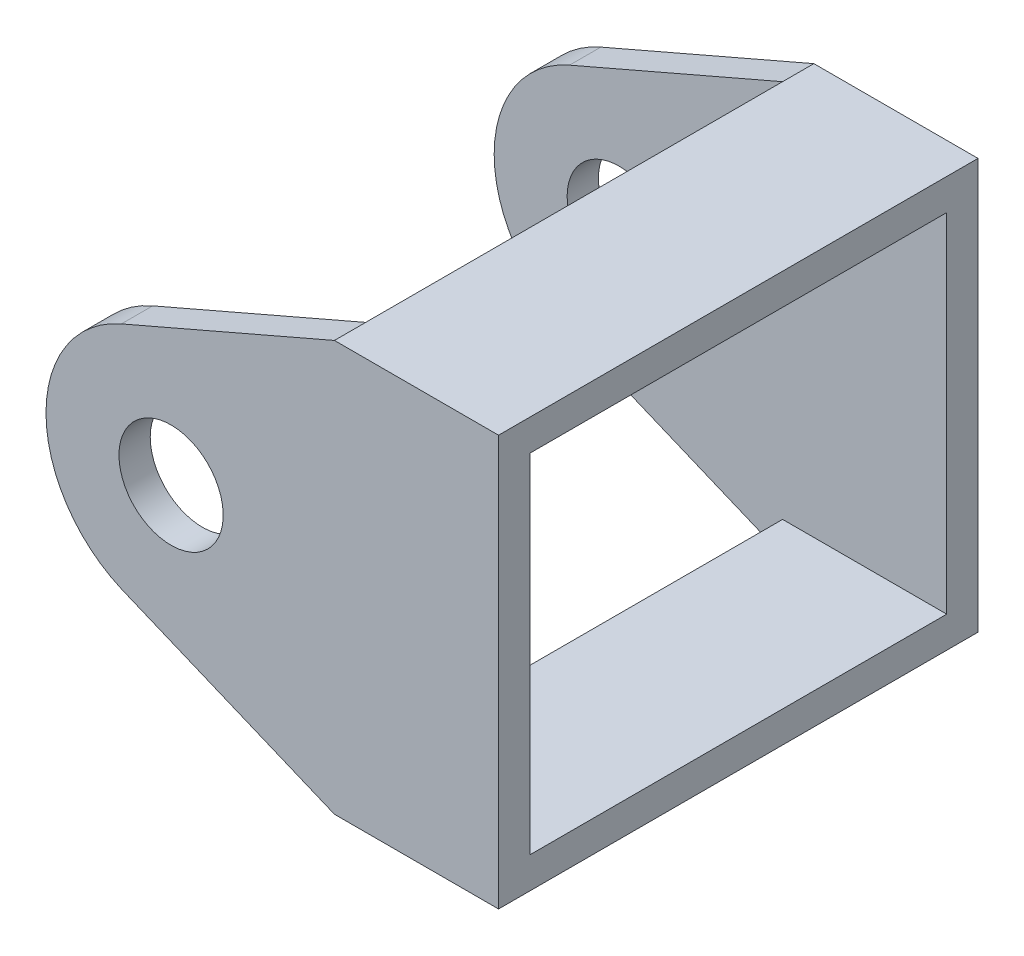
ISO-10303-21;
HEADER;
FILE_DESCRIPTION(('STEP AP214'),'2;1');
FILE_NAME('part.step','',(''),(''),'','','');
FILE_SCHEMA(('AUTOMOTIVE_DESIGN { 1 0 10303 214 1 1 1 1 }'));
ENDSEC;
DATA;
#1=APPLICATION_CONTEXT('core data for automotive mechanical design processes');
#2=APPLICATION_PROTOCOL_DEFINITION('international standard','automotive_design',2000,#1);
#3=PRODUCT_CONTEXT('',#1,'mechanical');
#4=PRODUCT('Part','Part','',(#3));
#5=PRODUCT_RELATED_PRODUCT_CATEGORY('part','',(#4));
#6=PRODUCT_DEFINITION_FORMATION('','',#4);
#7=PRODUCT_DEFINITION_CONTEXT('part definition',#1,'design');
#8=PRODUCT_DEFINITION('design','',#6,#7);
#9=PRODUCT_DEFINITION_SHAPE('','',#8);
#10=(LENGTH_UNIT() NAMED_UNIT(*) SI_UNIT(.MILLI.,.METRE.));
#11=(NAMED_UNIT(*) PLANE_ANGLE_UNIT() SI_UNIT($,.RADIAN.));
#12=(NAMED_UNIT(*) SI_UNIT($,.STERADIAN.) SOLID_ANGLE_UNIT());
#13=UNCERTAINTY_MEASURE_WITH_UNIT(LENGTH_MEASURE(1.E-05),#10,'distance_accuracy_value','');
#14=(GEOMETRIC_REPRESENTATION_CONTEXT(3) GLOBAL_UNCERTAINTY_ASSIGNED_CONTEXT((#13)) GLOBAL_UNIT_ASSIGNED_CONTEXT((#10,
#11,#12)) REPRESENTATION_CONTEXT('',''));
#15=CARTESIAN_POINT('',(0.,0.,0.));
#16=DIRECTION('',(0.,0.,1.));
#17=DIRECTION('',(1.,0.,0.));
#18=AXIS2_PLACEMENT_3D('',#15,#16,#17);
#19=CARTESIAN_POINT('',(-11.810708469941,-28.4050726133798,58.42));
#20=DIRECTION('',(0.383930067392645,0.923362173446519,0.));
#21=DIRECTION('',(-0.923362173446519,0.383930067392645,0.));
#22=AXIS2_PLACEMENT_3D('',#19,#20,#21);
#23=PLANE('',#22);
#24=DIRECTION('',(0.,0.,-1.));
#25=VECTOR('',#24,1.);
#26=CARTESIAN_POINT('',(-20.,-25.,58.42));
#27=LINE('',#26,#25);
#28=CARTESIAN_POINT('',(-20.,-25.,3.81));
#29=VERTEX_POINT('',#28);
#30=CARTESIAN_POINT('',(-20.,-25.,0.));
#31=VERTEX_POINT('',#30);
#32=EDGE_CURVE('E177',#29,#31,#27,.T.);
#33=ORIENTED_EDGE('',*,*,#32,.F.);
#34=DIRECTION('',(0.923362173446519,-0.383930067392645,0.));
#35=VECTOR('',#34,1.);
#36=CARTESIAN_POINT('',(-11.810708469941,-28.4050726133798,3.80999999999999));
#37=LINE('',#36,#35);
#38=CARTESIAN_POINT('',(-45.9577206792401,-14.2068900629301,3.80999999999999));
#39=VERTEX_POINT('',#38);
#40=EDGE_CURVE('E219',#39,#29,#37,.T.);
#41=ORIENTED_EDGE('',*,*,#40,.F.);
#42=DIRECTION('',(0.,0.,-1.));
#43=VECTOR('',#42,1.);
#44=CARTESIAN_POINT('',(-45.9577206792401,-14.2068900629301,58.42));
#45=LINE('',#44,#43);
#46=CARTESIAN_POINT('',(-45.9577206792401,-14.2068900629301,0.));
#47=VERTEX_POINT('',#46);
#48=EDGE_CURVE('E181',#39,#47,#45,.T.);
#49=ORIENTED_EDGE('',*,*,#48,.T.);
#50=DIRECTION('',(0.923362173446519,-0.383930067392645,0.));
#51=VECTOR('',#50,1.);
#52=CARTESIAN_POINT('',(-11.810708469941,-28.4050726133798,0.));
#53=LINE('',#52,#51);
#54=EDGE_CURVE('E257',#47,#31,#53,.T.);
#55=ORIENTED_EDGE('',*,*,#54,.T.);
#56=EDGE_LOOP('',(#33,#41,#49,#55));
#57=FACE_BOUND('',#56,.T.);
#58=ADVANCED_FACE('F34',(#57),#23,.F.);
#59=DIRECTION('',(-0.923362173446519,0.383930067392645,0.));
#60=VECTOR('',#59,1.);
#61=CARTESIAN_POINT('',(-11.810708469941,-28.4050726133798,54.61));
#62=LINE('',#61,#60);
#63=CARTESIAN_POINT('',(-20.,-25.,54.61));
#64=VERTEX_POINT('',#63);
#65=CARTESIAN_POINT('',(-45.9577206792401,-14.2068900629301,54.61));
#66=VERTEX_POINT('',#65);
#67=EDGE_CURVE('E226',#64,#66,#62,.T.);
#68=ORIENTED_EDGE('',*,*,#67,.F.);
#69=CARTESIAN_POINT('',(-20.,-25.,58.42));
#70=VERTEX_POINT('',#69);
#71=EDGE_CURVE('E178',#70,#64,#27,.T.);
#72=ORIENTED_EDGE('',*,*,#71,.F.);
#73=DIRECTION('',(0.923362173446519,-0.383930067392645,0.));
#74=VECTOR('',#73,1.);
#75=CARTESIAN_POINT('',(-11.810708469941,-28.4050726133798,58.42));
#76=LINE('',#75,#74);
#77=CARTESIAN_POINT('',(-45.9577206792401,-14.2068900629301,58.42));
#78=VERTEX_POINT('',#77);
#79=EDGE_CURVE('E240',#78,#70,#76,.T.);
#80=ORIENTED_EDGE('',*,*,#79,.F.);
#81=EDGE_CURVE('E182',#78,#66,#45,.T.);
#82=ORIENTED_EDGE('',*,*,#81,.T.);
#83=EDGE_LOOP('',(#68,#72,#80,#82));
#84=FACE_BOUND('',#83,.T.);
#85=ADVANCED_FACE('F300',(#84),#23,.F.);
#86=CARTESIAN_POINT('',(-12.2680259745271,28.3463263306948,58.42));
#87=DIRECTION('',(-0.397188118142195,0.917737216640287,0.));
#88=DIRECTION('',(-0.917737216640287,-0.397188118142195,0.));
#89=AXIS2_PLACEMENT_3D('',#86,#87,#88);
#90=PLANE('',#89);
#91=DIRECTION('',(0.917737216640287,0.397188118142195,0.));
#92=VECTOR('',#91,1.);
#93=CARTESIAN_POINT('',(-12.2680259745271,28.3463263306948,3.81));
#94=LINE('',#93,#92);
#95=CARTESIAN_POINT('',(-45.9577206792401,13.7657403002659,3.81));
#96=VERTEX_POINT('',#95);
#97=CARTESIAN_POINT('',(-20.,25.,3.81));
#98=VERTEX_POINT('',#97);
#99=EDGE_CURVE('E147',#96,#98,#94,.T.);
#100=ORIENTED_EDGE('',*,*,#99,.T.);
#101=DIRECTION('',(0.,0.,-1.));
#102=VECTOR('',#101,1.);
#103=CARTESIAN_POINT('',(-20.,25.,58.42));
#104=LINE('',#103,#102);
#105=CARTESIAN_POINT('',(-20.,25.,0.));
#106=VERTEX_POINT('',#105);
#107=EDGE_CURVE('E162',#98,#106,#104,.T.);
#108=ORIENTED_EDGE('',*,*,#107,.T.);
#109=DIRECTION('',(0.917737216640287,0.397188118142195,0.));
#110=VECTOR('',#109,1.);
#111=CARTESIAN_POINT('',(-12.2680259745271,28.3463263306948,0.));
#112=LINE('',#111,#110);
#113=CARTESIAN_POINT('',(-45.9577206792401,13.7657403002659,0.));
#114=VERTEX_POINT('',#113);
#115=EDGE_CURVE('E237',#114,#106,#112,.T.);
#116=ORIENTED_EDGE('',*,*,#115,.F.);
#117=DIRECTION('',(0.,0.,-1.));
#118=VECTOR('',#117,1.);
#119=CARTESIAN_POINT('',(-45.9577206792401,13.7657403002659,58.42));
#120=LINE('',#119,#118);
#121=EDGE_CURVE('E251',#96,#114,#120,.T.);
#122=ORIENTED_EDGE('',*,*,#121,.F.);
#123=EDGE_LOOP('',(#100,#108,#116,#122));
#124=FACE_BOUND('',#123,.T.);
#125=ADVANCED_FACE('F277',(#124),#90,.T.);
#126=CARTESIAN_POINT('',(-20.,25.,58.42));
#127=VERTEX_POINT('',#126);
#128=CARTESIAN_POINT('',(-20.,25.,54.61));
#129=VERTEX_POINT('',#128);
#130=EDGE_CURVE('E160',#127,#129,#104,.T.);
#131=ORIENTED_EDGE('',*,*,#130,.T.);
#132=DIRECTION('',(-0.917737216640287,-0.397188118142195,0.));
#133=VECTOR('',#132,1.);
#134=CARTESIAN_POINT('',(-12.2680259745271,28.3463263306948,54.61));
#135=LINE('',#134,#133);
#136=CARTESIAN_POINT('',(-45.9577206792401,13.7657403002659,54.61));
#137=VERTEX_POINT('',#136);
#138=EDGE_CURVE('E136',#129,#137,#135,.T.);
#139=ORIENTED_EDGE('',*,*,#138,.T.);
#140=CARTESIAN_POINT('',(-45.9577206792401,13.7657403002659,58.42));
#141=VERTEX_POINT('',#140);
#142=EDGE_CURVE('E172',#141,#137,#120,.T.);
#143=ORIENTED_EDGE('',*,*,#142,.F.);
#144=DIRECTION('',(0.917737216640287,0.397188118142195,0.));
#145=VECTOR('',#144,1.);
#146=CARTESIAN_POINT('',(-12.2680259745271,28.3463263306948,58.42));
#147=LINE('',#146,#145);
#148=EDGE_CURVE('E167',#141,#127,#147,.T.);
#149=ORIENTED_EDGE('',*,*,#148,.T.);
#150=EDGE_LOOP('',(#131,#139,#143,#149));
#151=FACE_BOUND('',#150,.T.);
#152=ADVANCED_FACE('F165',(#151),#90,.T.);
#153=CARTESIAN_POINT('',(20.,-21.19,54.61));
#154=DIRECTION('',(0.,1.,0.));
#155=DIRECTION('',(0.,0.,1.));
#156=AXIS2_PLACEMENT_3D('',#153,#154,#155);
#157=PLANE('',#156);
#158=DIRECTION('',(-1.,0.,0.));
#159=VECTOR('',#158,1.);
#160=CARTESIAN_POINT('',(20.,-21.19,3.80999999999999));
#161=LINE('',#160,#159);
#162=CARTESIAN_POINT('',(0.,-21.19,3.80999999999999));
#163=VERTEX_POINT('',#162);
#164=CARTESIAN_POINT('',(-20.,-21.19,3.81));
#165=VERTEX_POINT('',#164);
#166=EDGE_CURVE('E199',#163,#165,#161,.T.);
#167=ORIENTED_EDGE('',*,*,#166,.T.);
#168=DIRECTION('',(0.,0.,1.));
#169=VECTOR('',#168,1.);
#170=CARTESIAN_POINT('',(-20.,-21.19,54.61));
#171=LINE('',#170,#169);
#172=CARTESIAN_POINT('',(-20.,-21.19,54.61));
#173=VERTEX_POINT('',#172);
#174=EDGE_CURVE('E152',#165,#173,#171,.T.);
#175=ORIENTED_EDGE('',*,*,#174,.T.);
#176=DIRECTION('',(-1.,0.,0.));
#177=VECTOR('',#176,1.);
#178=CARTESIAN_POINT('',(20.,-21.19,54.61));
#179=LINE('',#178,#177);
#180=CARTESIAN_POINT('',(0.,-21.19,54.61));
#181=VERTEX_POINT('',#180);
#182=EDGE_CURVE('E201',#181,#173,#179,.T.);
#183=ORIENTED_EDGE('',*,*,#182,.F.);
#184=DIRECTION('',(0.,0.,1.));
#185=VECTOR('',#184,1.);
#186=CARTESIAN_POINT('',(0.,-21.19,58.42));
#187=LINE('',#186,#185);
#188=EDGE_CURVE('E42',#163,#181,#187,.T.);
#189=ORIENTED_EDGE('',*,*,#188,.F.);
#190=EDGE_LOOP('',(#167,#175,#183,#189));
#191=FACE_BOUND('',#190,.T.);
#192=ADVANCED_FACE('F198',(#191),#157,.T.);
#193=CARTESIAN_POINT('',(20.,21.19,54.61));
#194=DIRECTION('',(0.,-1.,0.));
#195=DIRECTION('',(0.,0.,-1.));
#196=AXIS2_PLACEMENT_3D('',#193,#194,#195);
#197=PLANE('',#196);
#198=DIRECTION('',(-1.,0.,0.));
#199=VECTOR('',#198,1.);
#200=CARTESIAN_POINT('',(20.,21.19,54.61));
#201=LINE('',#200,#199);
#202=CARTESIAN_POINT('',(0.,21.19,54.61));
#203=VERTEX_POINT('',#202);
#204=CARTESIAN_POINT('',(-20.,21.19,54.61));
#205=VERTEX_POINT('',#204);
#206=EDGE_CURVE('E212',#203,#205,#201,.T.);
#207=ORIENTED_EDGE('',*,*,#206,.T.);
#208=DIRECTION('',(0.,0.,-1.));
#209=VECTOR('',#208,1.);
#210=CARTESIAN_POINT('',(-20.,21.19,54.61));
#211=LINE('',#210,#209);
#212=CARTESIAN_POINT('',(-20.,21.19,3.81));
#213=VERTEX_POINT('',#212);
#214=EDGE_CURVE('E11',#205,#213,#211,.T.);
#215=ORIENTED_EDGE('',*,*,#214,.T.);
#216=DIRECTION('',(-1.,0.,0.));
#217=VECTOR('',#216,1.);
#218=CARTESIAN_POINT('',(20.,21.19,3.81));
#219=LINE('',#218,#217);
#220=CARTESIAN_POINT('',(0.,21.19,3.81));
#221=VERTEX_POINT('',#220);
#222=EDGE_CURVE('E208',#221,#213,#219,.T.);
#223=ORIENTED_EDGE('',*,*,#222,.F.);
#224=DIRECTION('',(0.,0.,-1.));
#225=VECTOR('',#224,1.);
#226=CARTESIAN_POINT('',(0.,21.19,58.42));
#227=LINE('',#226,#225);
#228=EDGE_CURVE('E210',#203,#221,#227,.T.);
#229=ORIENTED_EDGE('',*,*,#228,.F.);
#230=EDGE_LOOP('',(#207,#215,#223,#229));
#231=FACE_BOUND('',#230,.T.);
#232=ADVANCED_FACE('F306',(#231),#197,.T.);
#233=CARTESIAN_POINT('',(-39.9045737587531,-0.220574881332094,58.42));
#234=DIRECTION('',(0.,0.,-1.));
#235=DIRECTION('',(-1.,0.,0.));
#236=AXIS2_PLACEMENT_3D('',#233,#234,#235);
#237=CYLINDRICAL_SURFACE('',#236,15.24);
#238=ORIENTED_EDGE('',*,*,#142,.T.);
#239=CARTESIAN_POINT('',(-39.9045737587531,-0.220574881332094,54.61));
#240=DIRECTION('',(0.,0.,-1.));
#241=DIRECTION('',(-1.,0.,0.));
#242=AXIS2_PLACEMENT_3D('',#239,#240,#241);
#243=CIRCLE('',#242,15.24);
#244=EDGE_CURVE('E143',#66,#137,#243,.T.);
#245=ORIENTED_EDGE('',*,*,#244,.F.);
#246=ORIENTED_EDGE('',*,*,#81,.F.);
#247=CARTESIAN_POINT('',(-39.9045737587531,-0.220574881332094,58.42));
#248=DIRECTION('',(0.,0.,1.));
#249=DIRECTION('',(1.,0.,0.));
#250=AXIS2_PLACEMENT_3D('',#247,#248,#249);
#251=CIRCLE('',#250,15.24);
#252=EDGE_CURVE('E236',#141,#78,#251,.T.);
#253=ORIENTED_EDGE('',*,*,#252,.F.);
#254=EDGE_LOOP('',(#238,#245,#246,#253));
#255=FACE_BOUND('',#254,.T.);
#256=ADVANCED_FACE('F294',(#255),#237,.T.);
#257=CARTESIAN_POINT('',(-39.9045737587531,-0.220574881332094,3.80999999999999));
#258=DIRECTION('',(0.,0.,1.));
#259=DIRECTION('',(0.,-1.,0.));
#260=AXIS2_PLACEMENT_3D('',#257,#258,#259);
#261=CIRCLE('',#260,15.24);
#262=EDGE_CURVE('E217',#96,#39,#261,.T.);
#263=ORIENTED_EDGE('',*,*,#262,.F.);
#264=ORIENTED_EDGE('',*,*,#121,.T.);
#265=CARTESIAN_POINT('',(-39.9045737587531,-0.220574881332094,0.));
#266=DIRECTION('',(0.,0.,1.));
#267=DIRECTION('',(1.,0.,0.));
#268=AXIS2_PLACEMENT_3D('',#265,#266,#267);
#269=CIRCLE('',#268,15.24);
#270=EDGE_CURVE('E254',#114,#47,#269,.T.);
#271=ORIENTED_EDGE('',*,*,#270,.T.);
#272=ORIENTED_EDGE('',*,*,#48,.F.);
#273=EDGE_LOOP('',(#263,#264,#271,#272));
#274=FACE_BOUND('',#273,.T.);
#275=ADVANCED_FACE('F291',(#274),#237,.T.);
#276=CARTESIAN_POINT('',(0.,0.,58.42));
#277=DIRECTION('',(1.,0.,0.));
#278=DIRECTION('',(0.,0.,-1.));
#279=AXIS2_PLACEMENT_3D('',#276,#277,#278);
#280=PLANE('',#279);
#281=DIRECTION('',(0.,-1.,0.));
#282=VECTOR('',#281,1.);
#283=CARTESIAN_POINT('',(0.,0.,0.));
#284=LINE('',#283,#282);
#285=CARTESIAN_POINT('',(0.,25.,0.));
#286=VERTEX_POINT('',#285);
#287=CARTESIAN_POINT('',(0.,-25.,0.));
#288=VERTEX_POINT('',#287);
#289=EDGE_CURVE('E263',#286,#288,#284,.T.);
#290=ORIENTED_EDGE('',*,*,#289,.F.);
#291=DIRECTION('',(0.,0.,-1.));
#292=VECTOR('',#291,1.);
#293=CARTESIAN_POINT('',(0.,25.,58.42));
#294=LINE('',#293,#292);
#295=CARTESIAN_POINT('',(0.,25.,58.42));
#296=VERTEX_POINT('',#295);
#297=EDGE_CURVE('E168',#296,#286,#294,.T.);
#298=ORIENTED_EDGE('',*,*,#297,.F.);
#299=DIRECTION('',(0.,-1.,0.));
#300=VECTOR('',#299,1.);
#301=CARTESIAN_POINT('',(0.,0.,58.42));
#302=LINE('',#301,#300);
#303=CARTESIAN_POINT('',(0.,-25.,58.42));
#304=VERTEX_POINT('',#303);
#305=EDGE_CURVE('E245',#296,#304,#302,.T.);
#306=ORIENTED_EDGE('',*,*,#305,.T.);
#307=DIRECTION('',(0.,0.,-1.));
#308=VECTOR('',#307,1.);
#309=CARTESIAN_POINT('',(0.,-25.,58.42));
#310=LINE('',#309,#308);
#311=EDGE_CURVE('E170',#304,#288,#310,.T.);
#312=ORIENTED_EDGE('',*,*,#311,.T.);
#313=EDGE_LOOP('',(#290,#298,#306,#312));
#314=FACE_BOUND('',#313,.T.);
#315=ORIENTED_EDGE('',*,*,#188,.T.);
#316=DIRECTION('',(0.,1.,0.));
#317=VECTOR('',#316,1.);
#318=CARTESIAN_POINT('',(0.,0.,54.61));
#319=LINE('',#318,#317);
#320=EDGE_CURVE('E191',#181,#203,#319,.T.);
#321=ORIENTED_EDGE('',*,*,#320,.T.);
#322=ORIENTED_EDGE('',*,*,#228,.T.);
#323=DIRECTION('',(0.,-1.,0.));
#324=VECTOR('',#323,1.);
#325=CARTESIAN_POINT('',(0.,0.,3.81));
#326=LINE('',#325,#324);
#327=EDGE_CURVE('E193',#221,#163,#326,.T.);
#328=ORIENTED_EDGE('',*,*,#327,.T.);
#329=EDGE_LOOP('',(#315,#321,#322,#328));
#330=FACE_BOUND('',#329,.T.);
#331=ADVANCED_FACE('F189',(#314,#330),#280,.T.);
#332=CARTESIAN_POINT('',(-39.9045737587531,-0.220574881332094,58.42));
#333=DIRECTION('',(0.,0.,-1.));
#334=DIRECTION('',(-1.,0.,0.));
#335=AXIS2_PLACEMENT_3D('',#332,#333,#334);
#336=CYLINDRICAL_SURFACE('',#335,6.35);
#337=CARTESIAN_POINT('',(-39.9045737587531,-0.220574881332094,58.42));
#338=DIRECTION('',(0.,0.,1.));
#339=DIRECTION('',(1.,0.,0.));
#340=AXIS2_PLACEMENT_3D('',#337,#338,#339);
#341=CIRCLE('',#340,6.35);
#342=CARTESIAN_POINT('',(-46.2545737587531,-0.220574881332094,58.42));
#343=VERTEX_POINT('',#342);
#344=EDGE_CURVE('E233',#343,#343,#341,.T.);
#345=CARTESIAN_POINT('',(-39.9045737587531,-0.220574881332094,54.61));
#346=DIRECTION('',(0.,0.,-1.));
#347=DIRECTION('',(-1.,0.,0.));
#348=AXIS2_PLACEMENT_3D('',#345,#346,#347);
#349=CIRCLE('',#348,6.35);
#350=CARTESIAN_POINT('',(-46.2545737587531,-0.220574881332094,54.61));
#351=VERTEX_POINT('',#350);
#352=EDGE_CURVE('E228',#351,#351,#349,.T.);
#353=CARTESIAN_POINT('',(-46.2545737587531,-0.220574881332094,58.42));
#354=CARTESIAN_POINT('',(-46.2545737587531,-0.220574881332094,58.3803125));
#355=CARTESIAN_POINT('',(-46.2545737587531,-0.220574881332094,58.340625));
#356=CARTESIAN_POINT('',(-46.2545737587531,-0.220574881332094,58.26125));
#357=CARTESIAN_POINT('',(-46.2545737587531,-0.220574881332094,58.2215625));
#358=CARTESIAN_POINT('',(-46.2545737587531,-0.220574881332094,58.1421875));
#359=CARTESIAN_POINT('',(-46.2545737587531,-0.220574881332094,58.1025));
#360=CARTESIAN_POINT('',(-46.2545737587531,-0.220574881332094,58.023125));
#361=CARTESIAN_POINT('',(-46.2545737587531,-0.220574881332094,57.9834375));
#362=CARTESIAN_POINT('',(-46.2545737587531,-0.220574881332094,57.9040625));
#363=CARTESIAN_POINT('',(-46.2545737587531,-0.220574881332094,57.864375));
#364=CARTESIAN_POINT('',(-46.2545737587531,-0.220574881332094,57.785));
#365=CARTESIAN_POINT('',(-46.2545737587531,-0.220574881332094,57.7453125));
#366=CARTESIAN_POINT('',(-46.2545737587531,-0.220574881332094,57.6659375));
#367=CARTESIAN_POINT('',(-46.2545737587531,-0.220574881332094,57.62625));
#368=CARTESIAN_POINT('',(-46.2545737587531,-0.220574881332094,57.546875));
#369=CARTESIAN_POINT('',(-46.2545737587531,-0.220574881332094,57.5071875));
#370=CARTESIAN_POINT('',(-46.2545737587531,-0.220574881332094,57.4278125));
#371=CARTESIAN_POINT('',(-46.2545737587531,-0.220574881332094,57.388125));
#372=CARTESIAN_POINT('',(-46.2545737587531,-0.220574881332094,57.30875));
#373=CARTESIAN_POINT('',(-46.2545737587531,-0.220574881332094,57.2690625));
#374=CARTESIAN_POINT('',(-46.2545737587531,-0.220574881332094,57.1896875));
#375=CARTESIAN_POINT('',(-46.2545737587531,-0.220574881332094,57.15));
#376=CARTESIAN_POINT('',(-46.2545737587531,-0.220574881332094,57.070625));
#377=CARTESIAN_POINT('',(-46.2545737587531,-0.220574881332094,57.0309375));
#378=CARTESIAN_POINT('',(-46.2545737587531,-0.220574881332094,56.9515625));
#379=CARTESIAN_POINT('',(-46.2545737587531,-0.220574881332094,56.911875));
#380=CARTESIAN_POINT('',(-46.2545737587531,-0.220574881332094,56.8325));
#381=CARTESIAN_POINT('',(-46.2545737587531,-0.220574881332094,56.7928125));
#382=CARTESIAN_POINT('',(-46.2545737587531,-0.220574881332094,56.7134375));
#383=CARTESIAN_POINT('',(-46.2545737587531,-0.220574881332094,56.67375));
#384=CARTESIAN_POINT('',(-46.2545737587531,-0.220574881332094,56.594375));
#385=CARTESIAN_POINT('',(-46.2545737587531,-0.220574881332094,56.5546875));
#386=CARTESIAN_POINT('',(-46.2545737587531,-0.220574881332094,56.4753125));
#387=CARTESIAN_POINT('',(-46.2545737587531,-0.220574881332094,56.435625));
#388=CARTESIAN_POINT('',(-46.2545737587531,-0.220574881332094,56.35625));
#389=CARTESIAN_POINT('',(-46.2545737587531,-0.220574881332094,56.3165625));
#390=CARTESIAN_POINT('',(-46.2545737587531,-0.220574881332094,56.2371875));
#391=CARTESIAN_POINT('',(-46.2545737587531,-0.220574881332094,56.1975));
#392=CARTESIAN_POINT('',(-46.2545737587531,-0.220574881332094,56.118125));
#393=CARTESIAN_POINT('',(-46.2545737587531,-0.220574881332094,56.0784375));
#394=CARTESIAN_POINT('',(-46.2545737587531,-0.220574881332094,55.9990625));
#395=CARTESIAN_POINT('',(-46.2545737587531,-0.220574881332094,55.959375));
#396=CARTESIAN_POINT('',(-46.2545737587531,-0.220574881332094,55.88));
#397=CARTESIAN_POINT('',(-46.2545737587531,-0.220574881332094,55.8403125));
#398=CARTESIAN_POINT('',(-46.2545737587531,-0.220574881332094,55.7609375));
#399=CARTESIAN_POINT('',(-46.2545737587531,-0.220574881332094,55.72125));
#400=CARTESIAN_POINT('',(-46.2545737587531,-0.220574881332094,55.641875));
#401=CARTESIAN_POINT('',(-46.2545737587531,-0.220574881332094,55.6021875));
#402=CARTESIAN_POINT('',(-46.2545737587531,-0.220574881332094,55.5228125));
#403=CARTESIAN_POINT('',(-46.2545737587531,-0.220574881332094,55.483125));
#404=CARTESIAN_POINT('',(-46.2545737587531,-0.220574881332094,55.40375));
#405=CARTESIAN_POINT('',(-46.2545737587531,-0.220574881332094,55.3640625));
#406=CARTESIAN_POINT('',(-46.2545737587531,-0.220574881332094,55.2846875));
#407=CARTESIAN_POINT('',(-46.2545737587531,-0.220574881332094,55.245));
#408=CARTESIAN_POINT('',(-46.2545737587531,-0.220574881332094,55.165625));
#409=CARTESIAN_POINT('',(-46.2545737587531,-0.220574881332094,55.1259375));
#410=CARTESIAN_POINT('',(-46.2545737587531,-0.220574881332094,55.0465625));
#411=CARTESIAN_POINT('',(-46.2545737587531,-0.220574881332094,55.006875));
#412=CARTESIAN_POINT('',(-46.2545737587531,-0.220574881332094,54.9275));
#413=CARTESIAN_POINT('',(-46.2545737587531,-0.220574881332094,54.8878125));
#414=CARTESIAN_POINT('',(-46.2545737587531,-0.220574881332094,54.8084375));
#415=CARTESIAN_POINT('',(-46.2545737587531,-0.220574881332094,54.76875));
#416=CARTESIAN_POINT('',(-46.2545737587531,-0.220574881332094,54.689375));
#417=CARTESIAN_POINT('',(-46.2545737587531,-0.220574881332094,54.6496875));
#418=CARTESIAN_POINT('',(-46.2545737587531,-0.220574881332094,54.61));
#419=B_SPLINE_CURVE_WITH_KNOTS('',3,(#353,#354,#355,#356,#357,#358,#359,#360,#361,#362,#363,
#364,#365,#366,#367,#368,#369,#370,#371,#372,#373,#374,#375,#376,#377,#378,#379,#380,#381,#382,
#383,#384,#385,#386,#387,#388,#389,#390,#391,#392,#393,#394,#395,#396,#397,#398,#399,#400,#401,
#402,#403,#404,#405,#406,#407,#408,#409,#410,#411,#412,#413,#414,#415,#416,#417,#418),
.UNSPECIFIED.,.F.,.F.,(4,2,2,2,2,2,2,2,2,2,2,2,2,2,2,2,2,2,2,2,2,2,2,2,2,2,2,2,2,2,2,2,4),(0.,
0.119062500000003,0.238125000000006,0.357187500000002,0.476250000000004,0.5953125,
0.714375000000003,0.833437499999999,0.952500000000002,1.0715625,1.190625,1.3096875,1.42875,
1.5478125,1.666875,1.7859375,1.905,2.0240625,2.143125,2.2621875,2.38125,2.5003125,2.619375,
2.7384375,2.8575,2.97656249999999,3.095625,3.2146875,3.33375,3.4528125,3.571875,3.6909375,
3.80999999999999),.UNSPECIFIED.);
#420=EDGE_CURVE('BSEAM36',#343,#351,#419,.T.);
#421=ORIENTED_EDGE('',*,*,#344,.T.);
#422=ORIENTED_EDGE('',*,*,#352,.T.);
#423=ORIENTED_EDGE('',*,*,#420,.T.);
#424=ORIENTED_EDGE('',*,*,#420,.F.);
#425=EDGE_LOOP('',(#421,#423,#422,#424));
#426=FACE_BOUND('',#425,.T.);
#427=ADVANCED_FACE('F36',(#426),#336,.F.);
#428=CARTESIAN_POINT('',(-39.9045737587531,-0.220574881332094,0.));
#429=DIRECTION('',(0.,0.,1.));
#430=DIRECTION('',(1.,0.,0.));
#431=AXIS2_PLACEMENT_3D('',#428,#429,#430);
#432=CIRCLE('',#431,6.35);
#433=CARTESIAN_POINT('',(-46.2545737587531,-0.220574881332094,0.));
#434=VERTEX_POINT('',#433);
#435=EDGE_CURVE('E232',#434,#434,#432,.T.);
#436=CARTESIAN_POINT('',(-39.9045737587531,-0.220574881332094,3.80999999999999));
#437=DIRECTION('',(0.,0.,1.));
#438=DIRECTION('',(0.,-1.,0.));
#439=AXIS2_PLACEMENT_3D('',#436,#437,#438);
#440=CIRCLE('',#439,6.35);
#441=CARTESIAN_POINT('',(-46.2545737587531,-0.220574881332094,3.80999999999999));
#442=VERTEX_POINT('',#441);
#443=EDGE_CURVE('E221',#442,#442,#440,.T.);
#444=CARTESIAN_POINT('',(-46.2545737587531,-0.220574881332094,0.));
#445=CARTESIAN_POINT('',(-46.2545737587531,-0.220574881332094,0.0396875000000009));
#446=CARTESIAN_POINT('',(-46.2545737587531,-0.220574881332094,0.0793750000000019));
#447=CARTESIAN_POINT('',(-46.2545737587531,-0.220574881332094,0.158750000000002));
#448=CARTESIAN_POINT('',(-46.2545737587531,-0.220574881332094,0.1984375));
#449=CARTESIAN_POINT('',(-46.2545737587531,-0.220574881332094,0.2778125));
#450=CARTESIAN_POINT('',(-46.2545737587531,-0.220574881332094,0.317500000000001));
#451=CARTESIAN_POINT('',(-46.2545737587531,-0.220574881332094,0.396875));
#452=CARTESIAN_POINT('',(-46.2545737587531,-0.220574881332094,0.436562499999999));
#453=CARTESIAN_POINT('',(-46.2545737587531,-0.220574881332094,0.515937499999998));
#454=CARTESIAN_POINT('',(-46.2545737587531,-0.220574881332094,0.555624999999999));
#455=CARTESIAN_POINT('',(-46.2545737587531,-0.220574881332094,0.634999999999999));
#456=CARTESIAN_POINT('',(-46.2545737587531,-0.220574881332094,0.674687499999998));
#457=CARTESIAN_POINT('',(-46.2545737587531,-0.220574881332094,0.754062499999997));
#458=CARTESIAN_POINT('',(-46.2545737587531,-0.220574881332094,0.793749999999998));
#459=CARTESIAN_POINT('',(-46.2545737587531,-0.220574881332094,0.873124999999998));
#460=CARTESIAN_POINT('',(-46.2545737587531,-0.220574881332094,0.912812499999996));
#461=CARTESIAN_POINT('',(-46.2545737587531,-0.220574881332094,0.992187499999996));
#462=CARTESIAN_POINT('',(-46.2545737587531,-0.220574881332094,1.031875));
#463=CARTESIAN_POINT('',(-46.2545737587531,-0.220574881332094,1.11125));
#464=CARTESIAN_POINT('',(-46.2545737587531,-0.220574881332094,1.1509375));
#465=CARTESIAN_POINT('',(-46.2545737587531,-0.220574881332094,1.2303125));
#466=CARTESIAN_POINT('',(-46.2545737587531,-0.220574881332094,1.27));
#467=CARTESIAN_POINT('',(-46.2545737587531,-0.220574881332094,1.349375));
#468=CARTESIAN_POINT('',(-46.2545737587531,-0.220574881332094,1.3890625));
#469=CARTESIAN_POINT('',(-46.2545737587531,-0.220574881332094,1.4684375));
#470=CARTESIAN_POINT('',(-46.2545737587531,-0.220574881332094,1.508125));
#471=CARTESIAN_POINT('',(-46.2545737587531,-0.220574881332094,1.5875));
#472=CARTESIAN_POINT('',(-46.2545737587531,-0.220574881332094,1.6271875));
#473=CARTESIAN_POINT('',(-46.2545737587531,-0.220574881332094,1.7065625));
#474=CARTESIAN_POINT('',(-46.2545737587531,-0.220574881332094,1.74625));
#475=CARTESIAN_POINT('',(-46.2545737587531,-0.220574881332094,1.82562499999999));
#476=CARTESIAN_POINT('',(-46.2545737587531,-0.220574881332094,1.8653125));
#477=CARTESIAN_POINT('',(-46.2545737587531,-0.220574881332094,1.9446875));
#478=CARTESIAN_POINT('',(-46.2545737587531,-0.220574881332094,1.984375));
#479=CARTESIAN_POINT('',(-46.2545737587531,-0.220574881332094,2.06375));
#480=CARTESIAN_POINT('',(-46.2545737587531,-0.220574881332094,2.1034375));
#481=CARTESIAN_POINT('',(-46.2545737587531,-0.220574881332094,2.1828125));
#482=CARTESIAN_POINT('',(-46.2545737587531,-0.220574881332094,2.2225));
#483=CARTESIAN_POINT('',(-46.2545737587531,-0.220574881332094,2.301875));
#484=CARTESIAN_POINT('',(-46.2545737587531,-0.220574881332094,2.3415625));
#485=CARTESIAN_POINT('',(-46.2545737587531,-0.220574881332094,2.4209375));
#486=CARTESIAN_POINT('',(-46.2545737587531,-0.220574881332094,2.460625));
#487=CARTESIAN_POINT('',(-46.2545737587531,-0.220574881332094,2.54));
#488=CARTESIAN_POINT('',(-46.2545737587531,-0.220574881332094,2.57968749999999));
#489=CARTESIAN_POINT('',(-46.2545737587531,-0.220574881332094,2.65906249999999));
#490=CARTESIAN_POINT('',(-46.2545737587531,-0.220574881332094,2.69875));
#491=CARTESIAN_POINT('',(-46.2545737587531,-0.220574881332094,2.778125));
#492=CARTESIAN_POINT('',(-46.2545737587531,-0.220574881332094,2.8178125));
#493=CARTESIAN_POINT('',(-46.2545737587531,-0.220574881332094,2.8971875));
#494=CARTESIAN_POINT('',(-46.2545737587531,-0.220574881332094,2.936875));
#495=CARTESIAN_POINT('',(-46.2545737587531,-0.220574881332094,3.01625));
#496=CARTESIAN_POINT('',(-46.2545737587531,-0.220574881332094,3.0559375));
#497=CARTESIAN_POINT('',(-46.2545737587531,-0.220574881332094,3.1353125));
#498=CARTESIAN_POINT('',(-46.2545737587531,-0.220574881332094,3.17499999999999));
#499=CARTESIAN_POINT('',(-46.2545737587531,-0.220574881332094,3.25437499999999));
#500=CARTESIAN_POINT('',(-46.2545737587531,-0.220574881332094,3.2940625));
#501=CARTESIAN_POINT('',(-46.2545737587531,-0.220574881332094,3.37343749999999));
#502=CARTESIAN_POINT('',(-46.2545737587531,-0.220574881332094,3.41312499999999));
#503=CARTESIAN_POINT('',(-46.2545737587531,-0.220574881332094,3.49249999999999));
#504=CARTESIAN_POINT('',(-46.2545737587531,-0.220574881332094,3.53218749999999));
#505=CARTESIAN_POINT('',(-46.2545737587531,-0.220574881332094,3.61156249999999));
#506=CARTESIAN_POINT('',(-46.2545737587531,-0.220574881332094,3.65124999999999));
#507=CARTESIAN_POINT('',(-46.2545737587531,-0.220574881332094,3.73062499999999));
#508=CARTESIAN_POINT('',(-46.2545737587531,-0.220574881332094,3.77031249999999));
#509=CARTESIAN_POINT('',(-46.2545737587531,-0.220574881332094,3.80999999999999));
#510=B_SPLINE_CURVE_WITH_KNOTS('',3,(#444,#445,#446,#447,#448,#449,#450,#451,#452,#453,#454,
#455,#456,#457,#458,#459,#460,#461,#462,#463,#464,#465,#466,#467,#468,#469,#470,#471,#472,#473,
#474,#475,#476,#477,#478,#479,#480,#481,#482,#483,#484,#485,#486,#487,#488,#489,#490,#491,#492,
#493,#494,#495,#496,#497,#498,#499,#500,#501,#502,#503,#504,#505,#506,#507,#508,#509),
.UNSPECIFIED.,.F.,.F.,(4,2,2,2,2,2,2,2,2,2,2,2,2,2,2,2,2,2,2,2,2,2,2,2,2,2,2,2,2,2,2,2,4),(0.,
0.119062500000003,0.238124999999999,0.357187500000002,0.476249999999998,0.5953125,
0.714374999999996,0.833437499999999,0.952499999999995,1.0715625,1.190625,1.3096875,1.42875,
1.5478125,1.666875,1.78593749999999,1.905,2.0240625,2.143125,2.2621875,2.38124999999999,
2.5003125,2.61937499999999,2.7384375,2.8575,2.97656249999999,3.095625,3.21468749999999,3.33375,
3.45281249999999,3.571875,3.69093749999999,3.80999999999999),.UNSPECIFIED.);
#511=EDGE_CURVE('BSEAM324',#434,#442,#510,.T.);
#512=ORIENTED_EDGE('',*,*,#435,.F.);
#513=ORIENTED_EDGE('',*,*,#443,.T.);
#514=ORIENTED_EDGE('',*,*,#511,.T.);
#515=ORIENTED_EDGE('',*,*,#511,.F.);
#516=EDGE_LOOP('',(#512,#514,#513,#515));
#517=FACE_BOUND('',#516,.T.);
#518=ADVANCED_FACE('F324',(#517),#336,.F.);
#519=CARTESIAN_POINT('',(0.,-25.,58.42));
#520=DIRECTION('',(0.,-1.,0.));
#521=DIRECTION('',(1.,0.,0.));
#522=AXIS2_PLACEMENT_3D('',#519,#520,#521);
#523=PLANE('',#522);
#524=DIRECTION('',(-1.,0.,0.));
#525=VECTOR('',#524,1.);
#526=CARTESIAN_POINT('',(0.,-25.,0.));
#527=LINE('',#526,#525);
#528=EDGE_CURVE('E260',#288,#31,#527,.T.);
#529=ORIENTED_EDGE('',*,*,#528,.F.);
#530=ORIENTED_EDGE('',*,*,#311,.F.);
#531=DIRECTION('',(-1.,0.,0.));
#532=VECTOR('',#531,1.);
#533=CARTESIAN_POINT('',(0.,-25.,58.42));
#534=LINE('',#533,#532);
#535=EDGE_CURVE('E242',#304,#70,#534,.T.);
#536=ORIENTED_EDGE('',*,*,#535,.T.);
#537=ORIENTED_EDGE('',*,*,#71,.T.);
#538=DIRECTION('',(0.,0.,-1.));
#539=VECTOR('',#538,1.);
#540=CARTESIAN_POINT('',(-20.,-25.,58.42));
#541=LINE('',#540,#539);
#542=EDGE_CURVE('E163',#64,#29,#541,.T.);
#543=ORIENTED_EDGE('',*,*,#542,.T.);
#544=ORIENTED_EDGE('',*,*,#32,.T.);
#545=EDGE_LOOP('',(#529,#530,#536,#537,#543,#544));
#546=FACE_BOUND('',#545,.T.);
#547=ADVANCED_FACE('F283',(#546),#523,.T.);
#548=CARTESIAN_POINT('',(0.,25.,58.42));
#549=DIRECTION('',(0.,-1.,0.));
#550=DIRECTION('',(1.,0.,0.));
#551=AXIS2_PLACEMENT_3D('',#548,#549,#550);
#552=PLANE('',#551);
#553=DIRECTION('',(-1.,0.,0.));
#554=VECTOR('',#553,1.);
#555=CARTESIAN_POINT('',(0.,25.,0.));
#556=LINE('',#555,#554);
#557=EDGE_CURVE('E266',#286,#106,#556,.T.);
#558=ORIENTED_EDGE('',*,*,#557,.T.);
#559=ORIENTED_EDGE('',*,*,#107,.F.);
#560=DIRECTION('',(0.,0.,-1.));
#561=VECTOR('',#560,1.);
#562=CARTESIAN_POINT('',(-20.,25.,58.42));
#563=LINE('',#562,#561);
#564=EDGE_CURVE('E151',#129,#98,#563,.T.);
#565=ORIENTED_EDGE('',*,*,#564,.F.);
#566=ORIENTED_EDGE('',*,*,#130,.F.);
#567=DIRECTION('',(-1.,0.,0.));
#568=VECTOR('',#567,1.);
#569=CARTESIAN_POINT('',(0.,25.,58.42));
#570=LINE('',#569,#568);
#571=EDGE_CURVE('E248',#296,#127,#570,.T.);
#572=ORIENTED_EDGE('',*,*,#571,.F.);
#573=ORIENTED_EDGE('',*,*,#297,.T.);
#574=EDGE_LOOP('',(#558,#559,#565,#566,#572,#573));
#575=FACE_BOUND('',#574,.T.);
#576=ADVANCED_FACE('F158',(#575),#552,.F.);
#577=CARTESIAN_POINT('',(0.,0.,58.42));
#578=DIRECTION('',(0.,0.,1.));
#579=DIRECTION('',(1.,0.,0.));
#580=AXIS2_PLACEMENT_3D('',#577,#578,#579);
#581=PLANE('',#580);
#582=ORIENTED_EDGE('',*,*,#344,.F.);
#583=EDGE_LOOP('',(#582));
#584=FACE_BOUND('',#583,.T.);
#585=ORIENTED_EDGE('',*,*,#252,.T.);
#586=ORIENTED_EDGE('',*,*,#79,.T.);
#587=ORIENTED_EDGE('',*,*,#535,.F.);
#588=ORIENTED_EDGE('',*,*,#305,.F.);
#589=ORIENTED_EDGE('',*,*,#571,.T.);
#590=ORIENTED_EDGE('',*,*,#148,.F.);
#591=EDGE_LOOP('',(#585,#586,#587,#588,#589,#590));
#592=FACE_BOUND('',#591,.T.);
#593=ADVANCED_FACE('F297',(#584,#592),#581,.T.);
#594=CARTESIAN_POINT('',(0.,0.,0.));
#595=DIRECTION('',(0.,0.,1.));
#596=DIRECTION('',(1.,0.,0.));
#597=AXIS2_PLACEMENT_3D('',#594,#595,#596);
#598=PLANE('',#597);
#599=ORIENTED_EDGE('',*,*,#435,.T.);
#600=EDGE_LOOP('',(#599));
#601=FACE_BOUND('',#600,.T.);
#602=ORIENTED_EDGE('',*,*,#270,.F.);
#603=ORIENTED_EDGE('',*,*,#115,.T.);
#604=ORIENTED_EDGE('',*,*,#557,.F.);
#605=ORIENTED_EDGE('',*,*,#289,.T.);
#606=ORIENTED_EDGE('',*,*,#528,.T.);
#607=ORIENTED_EDGE('',*,*,#54,.F.);
#608=EDGE_LOOP('',(#602,#603,#604,#605,#606,#607));
#609=FACE_BOUND('',#608,.T.);
#610=ADVANCED_FACE('F272',(#601,#609),#598,.F.);
#611=CARTESIAN_POINT('',(20.,21.19,54.61));
#612=DIRECTION('',(0.,0.,-1.));
#613=DIRECTION('',(-1.,0.,0.));
#614=AXIS2_PLACEMENT_3D('',#611,#612,#613);
#615=PLANE('',#614);
#616=ORIENTED_EDGE('',*,*,#352,.F.);
#617=EDGE_LOOP('',(#616));
#618=FACE_BOUND('',#617,.T.);
#619=ORIENTED_EDGE('',*,*,#244,.T.);
#620=ORIENTED_EDGE('',*,*,#138,.F.);
#621=DIRECTION('',(0.,-1.,0.));
#622=VECTOR('',#621,1.);
#623=CARTESIAN_POINT('',(-20.,40.,54.61));
#624=LINE('',#623,#622);
#625=EDGE_CURVE('E140',#129,#205,#624,.T.);
#626=ORIENTED_EDGE('',*,*,#625,.T.);
#627=ORIENTED_EDGE('',*,*,#206,.F.);
#628=ORIENTED_EDGE('',*,*,#320,.F.);
#629=ORIENTED_EDGE('',*,*,#182,.T.);
#630=EDGE_CURVE('E49',#173,#64,#624,.T.);
#631=ORIENTED_EDGE('',*,*,#630,.T.);
#632=ORIENTED_EDGE('',*,*,#67,.T.);
#633=EDGE_LOOP('',(#619,#620,#626,#627,#628,#629,#631,#632));
#634=FACE_BOUND('',#633,.T.);
#635=ADVANCED_FACE('F138',(#618,#634),#615,.T.);
#636=CARTESIAN_POINT('',(20.,21.19,3.81));
#637=DIRECTION('',(0.,0.,1.));
#638=DIRECTION('',(0.,-1.,0.));
#639=AXIS2_PLACEMENT_3D('',#636,#637,#638);
#640=PLANE('',#639);
#641=ORIENTED_EDGE('',*,*,#443,.F.);
#642=EDGE_LOOP('',(#641));
#643=FACE_BOUND('',#642,.T.);
#644=ORIENTED_EDGE('',*,*,#40,.T.);
#645=DIRECTION('',(0.,-1.,0.));
#646=VECTOR('',#645,1.);
#647=CARTESIAN_POINT('',(-20.,40.,3.81));
#648=LINE('',#647,#646);
#649=EDGE_CURVE('E207',#165,#29,#648,.T.);
#650=ORIENTED_EDGE('',*,*,#649,.F.);
#651=ORIENTED_EDGE('',*,*,#166,.F.);
#652=ORIENTED_EDGE('',*,*,#327,.F.);
#653=ORIENTED_EDGE('',*,*,#222,.T.);
#654=EDGE_CURVE('E57',#98,#213,#648,.T.);
#655=ORIENTED_EDGE('',*,*,#654,.F.);
#656=ORIENTED_EDGE('',*,*,#99,.F.);
#657=ORIENTED_EDGE('',*,*,#262,.T.);
#658=EDGE_LOOP('',(#644,#650,#651,#652,#653,#655,#656,#657));
#659=FACE_BOUND('',#658,.T.);
#660=ADVANCED_FACE('F204',(#643,#659),#640,.T.);
#661=CARTESIAN_POINT('',(-20.,40.,3.81));
#662=DIRECTION('',(-1.,0.,0.));
#663=DIRECTION('',(0.,-1.,0.));
#664=AXIS2_PLACEMENT_3D('',#661,#662,#663);
#665=PLANE('',#664);
#666=ORIENTED_EDGE('',*,*,#564,.T.);
#667=ORIENTED_EDGE('',*,*,#654,.T.);
#668=ORIENTED_EDGE('',*,*,#214,.F.);
#669=ORIENTED_EDGE('',*,*,#625,.F.);
#670=EDGE_LOOP('',(#666,#667,#668,#669));
#671=FACE_BOUND('',#670,.T.);
#672=ADVANCED_FACE('F150',(#671),#665,.T.);
#673=ORIENTED_EDGE('',*,*,#630,.F.);
#674=ORIENTED_EDGE('',*,*,#174,.F.);
#675=ORIENTED_EDGE('',*,*,#649,.T.);
#676=ORIENTED_EDGE('',*,*,#542,.F.);
#677=EDGE_LOOP('',(#673,#674,#675,#676));
#678=FACE_BOUND('',#677,.T.);
#679=ADVANCED_FACE('F301',(#678),#665,.T.);
#680=CLOSED_SHELL('',(#58,#85,#125,#152,#192,#232,#256,#275,#331,#427,#518,#547,#576,#593,#610,
#635,#660,#672,#679));
#681=MANIFOLD_SOLID_BREP('B2',#680);
#682=ADVANCED_BREP_SHAPE_REPRESENTATION('',(#18,#681),#14);
#683=SHAPE_DEFINITION_REPRESENTATION(#9,#682);
ENDSEC;
END-ISO-10303-21;
